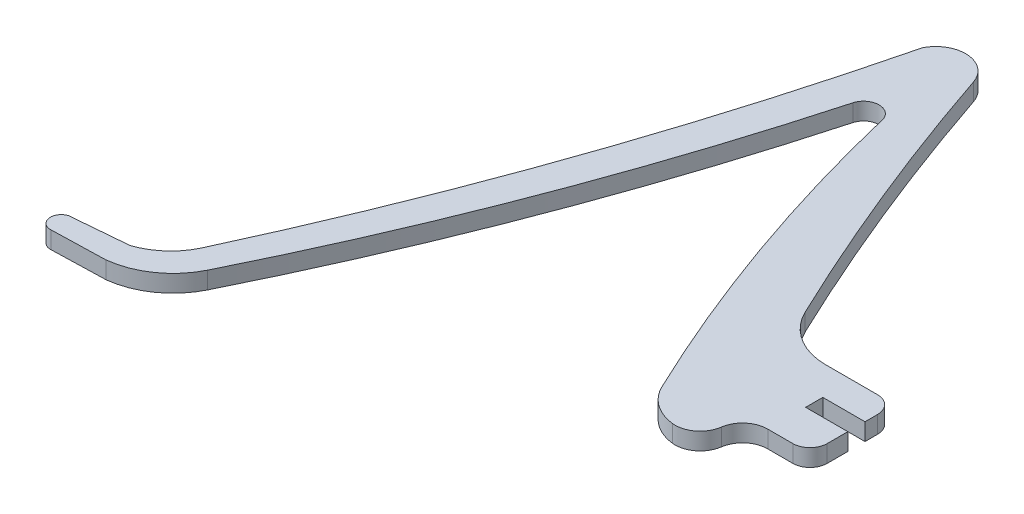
ISO-10303-21;
HEADER;
FILE_DESCRIPTION(('STEP AP214'),'2;1');
FILE_NAME('part.step','',(''),(''),'','','');
FILE_SCHEMA(('AUTOMOTIVE_DESIGN { 1 0 10303 214 1 1 1 1 }'));
ENDSEC;
DATA;
#1=APPLICATION_CONTEXT('core data for automotive mechanical design processes');
#2=APPLICATION_PROTOCOL_DEFINITION('international standard','automotive_design',2000,#1);
#3=PRODUCT_CONTEXT('',#1,'mechanical');
#4=PRODUCT('Part','Part','',(#3));
#5=PRODUCT_RELATED_PRODUCT_CATEGORY('part','',(#4));
#6=PRODUCT_DEFINITION_FORMATION('','',#4);
#7=PRODUCT_DEFINITION_CONTEXT('part definition',#1,'design');
#8=PRODUCT_DEFINITION('design','',#6,#7);
#9=PRODUCT_DEFINITION_SHAPE('','',#8);
#10=(LENGTH_UNIT() NAMED_UNIT(*) SI_UNIT(.MILLI.,.METRE.));
#11=(NAMED_UNIT(*) PLANE_ANGLE_UNIT() SI_UNIT($,.RADIAN.));
#12=(NAMED_UNIT(*) SI_UNIT($,.STERADIAN.) SOLID_ANGLE_UNIT());
#13=UNCERTAINTY_MEASURE_WITH_UNIT(LENGTH_MEASURE(1.E-05),#10,'distance_accuracy_value','');
#14=(GEOMETRIC_REPRESENTATION_CONTEXT(3) GLOBAL_UNCERTAINTY_ASSIGNED_CONTEXT((#13)) GLOBAL_UNIT_ASSIGNED_CONTEXT((#10,
#11,#12)) REPRESENTATION_CONTEXT('',''));
#15=CARTESIAN_POINT('',(0.,0.,0.));
#16=DIRECTION('',(0.,0.,1.));
#17=DIRECTION('',(1.,0.,0.));
#18=AXIS2_PLACEMENT_3D('',#15,#16,#17);
#19=CARTESIAN_POINT('',(-41738.6992189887,3.,-18363.9121093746));
#20=DIRECTION('',(0.,-1.,0.));
#21=DIRECTION('',(0.,0.,-1.));
#22=AXIS2_PLACEMENT_3D('',#19,#20,#21);
#23=CYLINDRICAL_SURFACE('',#22,1.8772510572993);
#24=CARTESIAN_POINT('',(-41738.6992189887,0.,-18363.9121093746));
#25=DIRECTION('',(0.,1.,0.));
#26=DIRECTION('',(0.,0.,1.));
#27=AXIS2_PLACEMENT_3D('',#24,#25,#26);
#28=CIRCLE('',#27,1.8772510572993);
#29=CARTESIAN_POINT('',(-41738.531777,0.,-18365.781878));
#30=VERTEX_POINT('',#29);
#31=CARTESIAN_POINT('',(-41738.64649,0.,-18362.035599));
#32=VERTEX_POINT('',#31);
#33=EDGE_CURVE('E228',#30,#32,#28,.T.);
#34=ORIENTED_EDGE('',*,*,#33,.T.);
#35=DIRECTION('',(0.,-1.,0.));
#36=VECTOR('',#35,1.);
#37=CARTESIAN_POINT('',(-41738.64649,3.,-18362.035599));
#38=LINE('',#37,#36);
#39=CARTESIAN_POINT('',(-41738.64649,3.,-18362.035599));
#40=VERTEX_POINT('',#39);
#41=EDGE_CURVE('E11',#40,#32,#38,.T.);
#42=ORIENTED_EDGE('',*,*,#41,.F.);
#43=CARTESIAN_POINT('',(-41738.6992189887,3.,-18363.9121093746));
#44=DIRECTION('',(0.,1.,0.));
#45=DIRECTION('',(0.,0.,1.));
#46=AXIS2_PLACEMENT_3D('',#43,#44,#45);
#47=CIRCLE('',#46,1.8772510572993);
#48=CARTESIAN_POINT('',(-41738.531777,3.,-18365.781878));
#49=VERTEX_POINT('',#48);
#50=EDGE_CURVE('E274',#49,#40,#47,.T.);
#51=ORIENTED_EDGE('',*,*,#50,.F.);
#52=DIRECTION('',(0.,-1.,0.));
#53=VECTOR('',#52,1.);
#54=CARTESIAN_POINT('',(-41738.531777,3.,-18365.781878));
#55=LINE('',#54,#53);
#56=EDGE_CURVE('E224',#49,#30,#55,.T.);
#57=ORIENTED_EDGE('',*,*,#56,.T.);
#58=EDGE_LOOP('',(#34,#42,#51,#57));
#59=FACE_BOUND('',#58,.T.);
#60=ADVANCED_FACE('F36',(#59),#23,.T.);
#61=CARTESIAN_POINT('',(-41738.64649,3.,-18362.035599));
#62=DIRECTION('',(-0.0281516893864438,0.,-0.999603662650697));
#63=DIRECTION('',(-0.999603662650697,0.,0.0281516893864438));
#64=AXIS2_PLACEMENT_3D('',#61,#62,#63);
#65=PLANE('',#64);
#66=DIRECTION('',(0.999603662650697,0.,-0.0281516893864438));
#67=VECTOR('',#66,1.);
#68=CARTESIAN_POINT('',(-41738.64649,0.,-18362.035599));
#69=LINE('',#68,#67);
#70=CARTESIAN_POINT('',(-41729.230469,0.,-18362.300781));
#71=VERTEX_POINT('',#70);
#72=EDGE_CURVE('E231',#32,#71,#69,.T.);
#73=ORIENTED_EDGE('',*,*,#72,.T.);
#74=DIRECTION('',(0.,-1.,0.));
#75=VECTOR('',#74,1.);
#76=CARTESIAN_POINT('',(-41729.230469,3.,-18362.300781));
#77=LINE('',#76,#75);
#78=CARTESIAN_POINT('',(-41729.230469,3.,-18362.300781));
#79=VERTEX_POINT('',#78);
#80=EDGE_CURVE('E44',#79,#71,#77,.T.);
#81=ORIENTED_EDGE('',*,*,#80,.F.);
#82=DIRECTION('',(0.999603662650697,0.,-0.0281516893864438));
#83=VECTOR('',#82,1.);
#84=CARTESIAN_POINT('',(-41738.64649,3.,-18362.035599));
#85=LINE('',#84,#83);
#86=EDGE_CURVE('E143',#40,#79,#85,.T.);
#87=ORIENTED_EDGE('',*,*,#86,.F.);
#88=ORIENTED_EDGE('',*,*,#41,.T.);
#89=EDGE_LOOP('',(#73,#81,#87,#88));
#90=FACE_BOUND('',#89,.T.);
#91=ADVANCED_FACE('F412',(#90),#65,.F.);
#92=CARTESIAN_POINT('',(-41730.7724777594,3.,-18375.5045827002));
#93=DIRECTION('',(0.,-1.,0.));
#94=DIRECTION('',(0.,0.,-1.));
#95=AXIS2_PLACEMENT_3D('',#92,#93,#94);
#96=CYLINDRICAL_SURFACE('',#95,13.2935386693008);
#97=CARTESIAN_POINT('',(-41730.7724777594,0.,-18375.5045827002));
#98=DIRECTION('',(0.,1.,0.));
#99=DIRECTION('',(0.,0.,1.));
#100=AXIS2_PLACEMENT_3D('',#97,#98,#99);
#101=CIRCLE('',#100,13.2935386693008);
#102=CARTESIAN_POINT('',(-41718.850758,0.,-18369.623191));
#103=VERTEX_POINT('',#102);
#104=EDGE_CURVE('E233',#71,#103,#101,.T.);
#105=ORIENTED_EDGE('',*,*,#104,.T.);
#106=DIRECTION('',(0.,-1.,0.));
#107=VECTOR('',#106,1.);
#108=CARTESIAN_POINT('',(-41718.850758,3.,-18369.623191));
#109=LINE('',#108,#107);
#110=CARTESIAN_POINT('',(-41718.850758,3.,-18369.623191));
#111=VERTEX_POINT('',#110);
#112=EDGE_CURVE('E329',#111,#103,#109,.T.);
#113=ORIENTED_EDGE('',*,*,#112,.F.);
#114=CARTESIAN_POINT('',(-41730.7724777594,3.,-18375.5045827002));
#115=DIRECTION('',(0.,1.,0.));
#116=DIRECTION('',(0.,0.,1.));
#117=AXIS2_PLACEMENT_3D('',#114,#115,#116);
#118=CIRCLE('',#117,13.2935386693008);
#119=EDGE_CURVE('E337',#79,#111,#118,.T.);
#120=ORIENTED_EDGE('',*,*,#119,.F.);
#121=ORIENTED_EDGE('',*,*,#80,.T.);
#122=EDGE_LOOP('',(#105,#113,#120,#121));
#123=FACE_BOUND('',#122,.T.);
#124=ADVANCED_FACE('F335',(#123),#96,.T.);
#125=CARTESIAN_POINT('',(-42131.7479660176,3.,-18573.2269802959));
#126=DIRECTION('',(0.,-1.,0.));
#127=DIRECTION('',(0.,0.,-1.));
#128=AXIS2_PLACEMENT_3D('',#125,#126,#127);
#129=CYLINDRICAL_SURFACE('',#128,460.367904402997);
#130=CARTESIAN_POINT('',(-42131.7479660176,0.,-18573.2269802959));
#131=DIRECTION('',(0.,1.,0.));
#132=DIRECTION('',(0.,0.,1.));
#133=AXIS2_PLACEMENT_3D('',#130,#131,#132);
#134=CIRCLE('',#133,460.367904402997);
#135=CARTESIAN_POINT('',(-41687.841823,0.,-18451.2190150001));
#136=VERTEX_POINT('',#135);
#137=EDGE_CURVE('E235',#103,#136,#134,.T.);
#138=ORIENTED_EDGE('',*,*,#137,.T.);
#139=DIRECTION('',(0.,-1.,0.));
#140=VECTOR('',#139,1.);
#141=CARTESIAN_POINT('',(-41687.841823,3.,-18451.2190150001));
#142=LINE('',#141,#140);
#143=CARTESIAN_POINT('',(-41687.841823,3.,-18451.2190150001));
#144=VERTEX_POINT('',#143);
#145=EDGE_CURVE('E326',#144,#136,#142,.T.);
#146=ORIENTED_EDGE('',*,*,#145,.F.);
#147=CARTESIAN_POINT('',(-42131.7479660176,3.,-18573.2269802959));
#148=DIRECTION('',(0.,1.,0.));
#149=DIRECTION('',(0.,0.,1.));
#150=AXIS2_PLACEMENT_3D('',#147,#148,#149);
#151=CIRCLE('',#150,460.367904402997);
#152=EDGE_CURVE('E355',#111,#144,#151,.T.);
#153=ORIENTED_EDGE('',*,*,#152,.F.);
#154=ORIENTED_EDGE('',*,*,#112,.T.);
#155=EDGE_LOOP('',(#138,#146,#153,#154));
#156=FACE_BOUND('',#155,.T.);
#157=ADVANCED_FACE('F346',(#156),#129,.T.);
#158=CARTESIAN_POINT('',(-41685.247483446,3.,-18450.5038166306));
#159=DIRECTION('',(0.,-1.,0.));
#160=DIRECTION('',(0.,0.,-1.));
#161=AXIS2_PLACEMENT_3D('',#158,#159,#160);
#162=CYLINDRICAL_SURFACE('',#161,2.69111620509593);
#163=CARTESIAN_POINT('',(-41685.247483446,0.,-18450.5038166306));
#164=DIRECTION('',(0.,-1.,0.));
#165=DIRECTION('',(0.,0.,1.));
#166=AXIS2_PLACEMENT_3D('',#163,#164,#165);
#167=CIRCLE('',#166,2.69111620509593);
#168=CARTESIAN_POINT('',(-41682.766146,0.,-18451.545484));
#169=VERTEX_POINT('',#168);
#170=EDGE_CURVE('E237',#136,#169,#167,.T.);
#171=ORIENTED_EDGE('',*,*,#170,.T.);
#172=DIRECTION('',(0.,-1.,0.));
#173=VECTOR('',#172,1.);
#174=CARTESIAN_POINT('',(-41682.766146,3.,-18451.545484));
#175=LINE('',#174,#173);
#176=CARTESIAN_POINT('',(-41682.766146,3.,-18451.545484));
#177=VERTEX_POINT('',#176);
#178=EDGE_CURVE('E323',#177,#169,#175,.T.);
#179=ORIENTED_EDGE('',*,*,#178,.F.);
#180=CARTESIAN_POINT('',(-41685.247483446,3.,-18450.5038166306));
#181=DIRECTION('',(0.,-1.,0.));
#182=DIRECTION('',(0.,0.,1.));
#183=AXIS2_PLACEMENT_3D('',#180,#181,#182);
#184=CIRCLE('',#183,2.69111620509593);
#185=EDGE_CURVE('E352',#144,#177,#184,.T.);
#186=ORIENTED_EDGE('',*,*,#185,.F.);
#187=ORIENTED_EDGE('',*,*,#145,.T.);
#188=EDGE_LOOP('',(#171,#179,#186,#187));
#189=FACE_BOUND('',#188,.T.);
#190=ADVANCED_FACE('F350',(#189),#162,.F.);
#191=CARTESIAN_POINT('',(-41390.6482191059,3.,-18521.1719345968));
#192=DIRECTION('',(0.,-1.,0.));
#193=DIRECTION('',(0.,0.,-1.));
#194=AXIS2_PLACEMENT_3D('',#191,#192,#193);
#195=CYLINDRICAL_SURFACE('',#194,300.301058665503);
#196=CARTESIAN_POINT('',(-41390.6482191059,0.,-18521.1719345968));
#197=DIRECTION('',(0.,1.,0.));
#198=DIRECTION('',(0.,0.,1.));
#199=AXIS2_PLACEMENT_3D('',#196,#197,#198);
#200=CIRCLE('',#199,300.301058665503);
#201=CARTESIAN_POINT('',(-41661.5612450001,0.,-18391.607826));
#202=VERTEX_POINT('',#201);
#203=EDGE_CURVE('E239',#169,#202,#200,.T.);
#204=ORIENTED_EDGE('',*,*,#203,.T.);
#205=DIRECTION('',(0.,-1.,0.));
#206=VECTOR('',#205,1.);
#207=CARTESIAN_POINT('',(-41661.5612450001,3.,-18391.607826));
#208=LINE('',#207,#206);
#209=CARTESIAN_POINT('',(-41661.5612450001,3.,-18391.607826));
#210=VERTEX_POINT('',#209);
#211=EDGE_CURVE('E320',#210,#202,#208,.T.);
#212=ORIENTED_EDGE('',*,*,#211,.F.);
#213=CARTESIAN_POINT('',(-41390.6482191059,3.,-18521.1719345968));
#214=DIRECTION('',(0.,1.,0.));
#215=DIRECTION('',(0.,0.,1.));
#216=AXIS2_PLACEMENT_3D('',#213,#214,#215);
#217=CIRCLE('',#216,300.301058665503);
#218=EDGE_CURVE('E354',#177,#210,#217,.T.);
#219=ORIENTED_EDGE('',*,*,#218,.F.);
#220=ORIENTED_EDGE('',*,*,#178,.T.);
#221=EDGE_LOOP('',(#204,#212,#219,#220));
#222=FACE_BOUND('',#221,.T.);
#223=ADVANCED_FACE('F425',(#222),#195,.T.);
#224=CARTESIAN_POINT('',(-41654.1774722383,3.,-18395.1398811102));
#225=DIRECTION('',(0.,-1.,0.));
#226=DIRECTION('',(0.,0.,-1.));
#227=AXIS2_PLACEMENT_3D('',#224,#225,#226);
#228=CYLINDRICAL_SURFACE('',#227,8.18507871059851);
#229=CARTESIAN_POINT('',(-41654.1774722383,0.,-18395.1398811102));
#230=DIRECTION('',(0.,1.,0.));
#231=DIRECTION('',(0.,0.,1.));
#232=AXIS2_PLACEMENT_3D('',#229,#230,#231);
#233=CIRCLE('',#232,8.18507871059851);
#234=CARTESIAN_POINT('',(-41655.13076,0.,-18387.0105049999));
#235=VERTEX_POINT('',#234);
#236=EDGE_CURVE('E241',#202,#235,#233,.T.);
#237=ORIENTED_EDGE('',*,*,#236,.T.);
#238=DIRECTION('',(0.,-1.,0.));
#239=VECTOR('',#238,1.);
#240=CARTESIAN_POINT('',(-41655.13076,3.,-18387.0105049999));
#241=LINE('',#240,#239);
#242=CARTESIAN_POINT('',(-41655.13076,3.,-18387.0105049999));
#243=VERTEX_POINT('',#242);
#244=EDGE_CURVE('E317',#243,#235,#241,.T.);
#245=ORIENTED_EDGE('',*,*,#244,.F.);
#246=CARTESIAN_POINT('',(-41654.1774722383,3.,-18395.1398811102));
#247=DIRECTION('',(0.,1.,0.));
#248=DIRECTION('',(0.,0.,1.));
#249=AXIS2_PLACEMENT_3D('',#246,#247,#248);
#250=CIRCLE('',#249,8.18507871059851);
#251=EDGE_CURVE('E357',#210,#243,#250,.T.);
#252=ORIENTED_EDGE('',*,*,#251,.F.);
#253=ORIENTED_EDGE('',*,*,#211,.T.);
#254=EDGE_LOOP('',(#237,#245,#252,#253));
#255=FACE_BOUND('',#254,.T.);
#256=ADVANCED_FACE('F428',(#255),#228,.T.);
#257=CARTESIAN_POINT('',(-41654.621781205,3.,-18391.3510327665));
#258=DIRECTION('',(0.,-1.,0.));
#259=DIRECTION('',(0.,0.,-1.));
#260=AXIS2_PLACEMENT_3D('',#257,#258,#259);
#261=CYLINDRICAL_SURFACE('',#260,4.37026780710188);
#262=CARTESIAN_POINT('',(-41654.621781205,0.,-18391.3510327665));
#263=DIRECTION('',(0.,1.,0.));
#264=DIRECTION('',(0.,0.,1.));
#265=AXIS2_PLACEMENT_3D('',#262,#263,#264);
#266=CIRCLE('',#265,4.37026780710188);
#267=CARTESIAN_POINT('',(-41650.295225,0.,-18390.734468));
#268=VERTEX_POINT('',#267);
#269=EDGE_CURVE('E243',#235,#268,#266,.T.);
#270=ORIENTED_EDGE('',*,*,#269,.T.);
#271=DIRECTION('',(0.,-1.,0.));
#272=VECTOR('',#271,1.);
#273=CARTESIAN_POINT('',(-41650.295225,3.,-18390.734468));
#274=LINE('',#273,#272);
#275=CARTESIAN_POINT('',(-41650.295225,3.,-18390.734468));
#276=VERTEX_POINT('',#275);
#277=EDGE_CURVE('E314',#276,#268,#274,.T.);
#278=ORIENTED_EDGE('',*,*,#277,.F.);
#279=CARTESIAN_POINT('',(-41654.621781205,3.,-18391.3510327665));
#280=DIRECTION('',(0.,1.,0.));
#281=DIRECTION('',(0.,0.,1.));
#282=AXIS2_PLACEMENT_3D('',#279,#280,#281);
#283=CIRCLE('',#282,4.37026780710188);
#284=EDGE_CURVE('E363',#243,#276,#283,.T.);
#285=ORIENTED_EDGE('',*,*,#284,.F.);
#286=ORIENTED_EDGE('',*,*,#244,.T.);
#287=EDGE_LOOP('',(#270,#278,#285,#286));
#288=FACE_BOUND('',#287,.T.);
#289=ADVANCED_FACE('F432',(#288),#261,.T.);
#290=CARTESIAN_POINT('',(-41645.9821666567,3.,-18390.1176820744));
#291=DIRECTION('',(0.,-1.,0.));
#292=DIRECTION('',(0.,0.,-1.));
#293=AXIS2_PLACEMENT_3D('',#290,#291,#292);
#294=CYLINDRICAL_SURFACE('',#293,4.35693667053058);
#295=CARTESIAN_POINT('',(-41645.9821666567,0.,-18390.1176820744));
#296=DIRECTION('',(0.,-1.,0.));
#297=DIRECTION('',(0.,0.,1.));
#298=AXIS2_PLACEMENT_3D('',#295,#296,#297);
#299=CIRCLE('',#298,4.35693667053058);
#300=CARTESIAN_POINT('',(-41645.943257,0.,-18394.4744449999));
#301=VERTEX_POINT('',#300);
#302=EDGE_CURVE('E245',#268,#301,#299,.T.);
#303=ORIENTED_EDGE('',*,*,#302,.T.);
#304=DIRECTION('',(0.,-1.,0.));
#305=VECTOR('',#304,1.);
#306=CARTESIAN_POINT('',(-41645.943257,3.,-18394.4744449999));
#307=LINE('',#306,#305);
#308=CARTESIAN_POINT('',(-41645.943257,3.,-18394.4744449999));
#309=VERTEX_POINT('',#308);
#310=EDGE_CURVE('E311',#309,#301,#307,.T.);
#311=ORIENTED_EDGE('',*,*,#310,.F.);
#312=CARTESIAN_POINT('',(-41645.9821666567,3.,-18390.1176820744));
#313=DIRECTION('',(0.,-1.,0.));
#314=DIRECTION('',(0.,0.,1.));
#315=AXIS2_PLACEMENT_3D('',#312,#313,#314);
#316=CIRCLE('',#315,4.35693667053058);
#317=EDGE_CURVE('E365',#276,#309,#316,.T.);
#318=ORIENTED_EDGE('',*,*,#317,.F.);
#319=ORIENTED_EDGE('',*,*,#277,.T.);
#320=EDGE_LOOP('',(#303,#311,#318,#319));
#321=FACE_BOUND('',#320,.T.);
#322=ADVANCED_FACE('F436',(#321),#294,.F.);
#323=CARTESIAN_POINT('',(-41645.943257,3.,-18394.4744449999));
#324=DIRECTION('',(-0.000484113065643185,0.,-0.999999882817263));
#325=DIRECTION('',(-0.999999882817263,0.,0.000484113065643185));
#326=AXIS2_PLACEMENT_3D('',#323,#324,#325);
#327=PLANE('',#326);
#328=DIRECTION('',(0.999999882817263,0.,-0.000484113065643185));
#329=VECTOR('',#328,1.);
#330=CARTESIAN_POINT('',(-41645.943257,0.,-18394.4744449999));
#331=LINE('',#330,#329);
#332=CARTESIAN_POINT('',(-41641.570312,0.,-18394.476562));
#333=VERTEX_POINT('',#332);
#334=EDGE_CURVE('E247',#301,#333,#331,.T.);
#335=ORIENTED_EDGE('',*,*,#334,.T.);
#336=DIRECTION('',(0.,-1.,0.));
#337=VECTOR('',#336,1.);
#338=CARTESIAN_POINT('',(-41641.570312,3.,-18394.476562));
#339=LINE('',#338,#337);
#340=CARTESIAN_POINT('',(-41641.570312,3.,-18394.476562));
#341=VERTEX_POINT('',#340);
#342=EDGE_CURVE('E308',#341,#333,#339,.T.);
#343=ORIENTED_EDGE('',*,*,#342,.F.);
#344=DIRECTION('',(0.999999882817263,0.,-0.000484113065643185));
#345=VECTOR('',#344,1.);
#346=CARTESIAN_POINT('',(-41645.943257,3.,-18394.4744449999));
#347=LINE('',#346,#345);
#348=EDGE_CURVE('E367',#309,#341,#347,.T.);
#349=ORIENTED_EDGE('',*,*,#348,.F.);
#350=ORIENTED_EDGE('',*,*,#310,.T.);
#351=EDGE_LOOP('',(#335,#343,#349,#350));
#352=FACE_BOUND('',#351,.T.);
#353=ADVANCED_FACE('F440',(#352),#327,.F.);
#354=CARTESIAN_POINT('',(-41641.5703122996,3.,-18397.4765617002));
#355=DIRECTION('',(0.,-1.,0.));
#356=DIRECTION('',(0.,0.,-1.));
#357=AXIS2_PLACEMENT_3D('',#354,#355,#356);
#358=CYLINDRICAL_SURFACE('',#357,2.99999970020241);
#359=CARTESIAN_POINT('',(-41641.5703122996,0.,-18397.4765617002));
#360=DIRECTION('',(0.,1.,0.));
#361=DIRECTION('',(0.,0.,1.));
#362=AXIS2_PLACEMENT_3D('',#359,#360,#361);
#363=CIRCLE('',#362,2.99999970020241);
#364=CARTESIAN_POINT('',(-41638.570313,0.,-18397.478112));
#365=VERTEX_POINT('',#364);
#366=EDGE_CURVE('E249',#333,#365,#363,.T.);
#367=ORIENTED_EDGE('',*,*,#366,.T.);
#368=DIRECTION('',(0.,-1.,0.));
#369=VECTOR('',#368,1.);
#370=CARTESIAN_POINT('',(-41638.570313,3.,-18397.478112));
#371=LINE('',#370,#369);
#372=CARTESIAN_POINT('',(-41638.570313,3.,-18397.478112));
#373=VERTEX_POINT('',#372);
#374=EDGE_CURVE('E305',#373,#365,#371,.T.);
#375=ORIENTED_EDGE('',*,*,#374,.F.);
#376=CARTESIAN_POINT('',(-41641.5703122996,3.,-18397.4765617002));
#377=DIRECTION('',(0.,1.,0.));
#378=DIRECTION('',(0.,0.,1.));
#379=AXIS2_PLACEMENT_3D('',#376,#377,#378);
#380=CIRCLE('',#379,2.99999970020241);
#381=EDGE_CURVE('E369',#341,#373,#380,.T.);
#382=ORIENTED_EDGE('',*,*,#381,.F.);
#383=ORIENTED_EDGE('',*,*,#342,.T.);
#384=EDGE_LOOP('',(#367,#375,#382,#383));
#385=FACE_BOUND('',#384,.T.);
#386=ADVANCED_FACE('F444',(#385),#358,.T.);
#387=CARTESIAN_POINT('',(-41638.570313,3.,-18397.478112));
#388=DIRECTION('',(-0.999999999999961,0.,-2.78067644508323E-07));
#389=DIRECTION('',(-2.78067644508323E-07,0.,0.999999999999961));
#390=AXIS2_PLACEMENT_3D('',#387,#388,#389);
#391=PLANE('',#390);
#392=DIRECTION('',(2.78067644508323E-07,0.,-0.999999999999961));
#393=VECTOR('',#392,1.);
#394=CARTESIAN_POINT('',(-41638.570313,0.,-18397.478112));
#395=LINE('',#394,#393);
#396=CARTESIAN_POINT('',(-41638.570312,0.,-18401.074219));
#397=VERTEX_POINT('',#396);
#398=EDGE_CURVE('E251',#365,#397,#395,.T.);
#399=ORIENTED_EDGE('',*,*,#398,.T.);
#400=DIRECTION('',(0.,-1.,0.));
#401=VECTOR('',#400,1.);
#402=CARTESIAN_POINT('',(-41638.570312,3.,-18401.074219));
#403=LINE('',#402,#401);
#404=CARTESIAN_POINT('',(-41638.570312,3.,-18401.074219));
#405=VERTEX_POINT('',#404);
#406=EDGE_CURVE('E302',#405,#397,#403,.T.);
#407=ORIENTED_EDGE('',*,*,#406,.F.);
#408=DIRECTION('',(2.78067644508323E-07,0.,-0.999999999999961));
#409=VECTOR('',#408,1.);
#410=CARTESIAN_POINT('',(-41638.570313,3.,-18397.478112));
#411=LINE('',#410,#409);
#412=EDGE_CURVE('E371',#373,#405,#411,.T.);
#413=ORIENTED_EDGE('',*,*,#412,.F.);
#414=ORIENTED_EDGE('',*,*,#374,.T.);
#415=EDGE_LOOP('',(#399,#407,#413,#414));
#416=FACE_BOUND('',#415,.T.);
#417=ADVANCED_FACE('F448',(#416),#391,.F.);
#418=CARTESIAN_POINT('',(-41638.570312,3.,-18401.074219));
#419=DIRECTION('',(0.,0.,1.));
#420=DIRECTION('',(1.,0.,0.));
#421=AXIS2_PLACEMENT_3D('',#418,#419,#420);
#422=PLANE('',#421);
#423=DIRECTION('',(-1.,0.,0.));
#424=VECTOR('',#423,1.);
#425=CARTESIAN_POINT('',(-41638.570312,0.,-18401.074219));
#426=LINE('',#425,#424);
#427=CARTESIAN_POINT('',(-41645.933594,0.,-18401.074219));
#428=VERTEX_POINT('',#427);
#429=EDGE_CURVE('E253',#397,#428,#426,.T.);
#430=ORIENTED_EDGE('',*,*,#429,.T.);
#431=DIRECTION('',(0.,-1.,0.));
#432=VECTOR('',#431,1.);
#433=CARTESIAN_POINT('',(-41645.933594,3.,-18401.074219));
#434=LINE('',#433,#432);
#435=CARTESIAN_POINT('',(-41645.933594,3.,-18401.074219));
#436=VERTEX_POINT('',#435);
#437=EDGE_CURVE('E299',#436,#428,#434,.T.);
#438=ORIENTED_EDGE('',*,*,#437,.F.);
#439=DIRECTION('',(-1.,0.,0.));
#440=VECTOR('',#439,1.);
#441=CARTESIAN_POINT('',(-41638.570312,3.,-18401.074219));
#442=LINE('',#441,#440);
#443=EDGE_CURVE('E373',#405,#436,#442,.T.);
#444=ORIENTED_EDGE('',*,*,#443,.F.);
#445=ORIENTED_EDGE('',*,*,#406,.T.);
#446=EDGE_LOOP('',(#430,#438,#444,#445));
#447=FACE_BOUND('',#446,.T.);
#448=ADVANCED_FACE('F452',(#447),#422,.F.);
#449=CARTESIAN_POINT('',(-41645.933594,3.,-18401.074219));
#450=DIRECTION('',(-0.999999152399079,0.,0.00130199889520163));
#451=DIRECTION('',(0.00130199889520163,0.,0.999999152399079));
#452=AXIS2_PLACEMENT_3D('',#449,#450,#451);
#453=PLANE('',#452);
#454=DIRECTION('',(-0.00130199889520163,0.,-0.999999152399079));
#455=VECTOR('',#454,1.);
#456=CARTESIAN_POINT('',(-41645.933594,0.,-18401.074219));
#457=LINE('',#456,#455);
#458=CARTESIAN_POINT('',(-41645.9375,0.,-18404.074219));
#459=VERTEX_POINT('',#458);
#460=EDGE_CURVE('E255',#428,#459,#457,.T.);
#461=ORIENTED_EDGE('',*,*,#460,.T.);
#462=DIRECTION('',(0.,-1.,0.));
#463=VECTOR('',#462,1.);
#464=CARTESIAN_POINT('',(-41645.9375,3.,-18404.074219));
#465=LINE('',#464,#463);
#466=CARTESIAN_POINT('',(-41645.9375,3.,-18404.074219));
#467=VERTEX_POINT('',#466);
#468=EDGE_CURVE('E296',#467,#459,#465,.T.);
#469=ORIENTED_EDGE('',*,*,#468,.F.);
#470=DIRECTION('',(-0.00130199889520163,0.,-0.999999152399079));
#471=VECTOR('',#470,1.);
#472=CARTESIAN_POINT('',(-41645.933594,3.,-18401.074219));
#473=LINE('',#472,#471);
#474=EDGE_CURVE('E375',#436,#467,#473,.T.);
#475=ORIENTED_EDGE('',*,*,#474,.F.);
#476=ORIENTED_EDGE('',*,*,#437,.T.);
#477=EDGE_LOOP('',(#461,#469,#475,#476));
#478=FACE_BOUND('',#477,.T.);
#479=ADVANCED_FACE('F456',(#478),#453,.F.);
#480=CARTESIAN_POINT('',(-41645.9375,3.,-18404.074219));
#481=DIRECTION('',(0.,0.,-1.));
#482=DIRECTION('',(-1.,0.,0.));
#483=AXIS2_PLACEMENT_3D('',#480,#481,#482);
#484=PLANE('',#483);
#485=DIRECTION('',(1.,0.,0.));
#486=VECTOR('',#485,1.);
#487=CARTESIAN_POINT('',(-41645.9375,0.,-18404.074219));
#488=LINE('',#487,#486);
#489=CARTESIAN_POINT('',(-41638.574219,0.,-18404.074219));
#490=VERTEX_POINT('',#489);
#491=EDGE_CURVE('E257',#459,#490,#488,.T.);
#492=ORIENTED_EDGE('',*,*,#491,.T.);
#493=DIRECTION('',(0.,-1.,0.));
#494=VECTOR('',#493,1.);
#495=CARTESIAN_POINT('',(-41638.574219,3.,-18404.074219));
#496=LINE('',#495,#494);
#497=CARTESIAN_POINT('',(-41638.574219,3.,-18404.074219));
#498=VERTEX_POINT('',#497);
#499=EDGE_CURVE('E293',#498,#490,#496,.T.);
#500=ORIENTED_EDGE('',*,*,#499,.F.);
#501=DIRECTION('',(1.,0.,0.));
#502=VECTOR('',#501,1.);
#503=CARTESIAN_POINT('',(-41645.9375,3.,-18404.074219));
#504=LINE('',#503,#502);
#505=EDGE_CURVE('E377',#467,#498,#504,.T.);
#506=ORIENTED_EDGE('',*,*,#505,.F.);
#507=ORIENTED_EDGE('',*,*,#468,.T.);
#508=EDGE_LOOP('',(#492,#500,#506,#507));
#509=FACE_BOUND('',#508,.T.);
#510=ADVANCED_FACE('F460',(#509),#484,.F.);
#511=CARTESIAN_POINT('',(-41638.574219,3.,-18404.074219));
#512=DIRECTION('',(-0.999998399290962,0.,-0.0017892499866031));
#513=DIRECTION('',(-0.0017892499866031,0.,0.999998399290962));
#514=AXIS2_PLACEMENT_3D('',#511,#512,#513);
#515=PLANE('',#514);
#516=DIRECTION('',(0.0017892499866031,0.,-0.999998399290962));
#517=VECTOR('',#516,1.);
#518=CARTESIAN_POINT('',(-41638.574219,0.,-18404.074219));
#519=LINE('',#518,#517);
#520=CARTESIAN_POINT('',(-41638.570312,0.,-18406.257812));
#521=VERTEX_POINT('',#520);
#522=EDGE_CURVE('E259',#490,#521,#519,.T.);
#523=ORIENTED_EDGE('',*,*,#522,.T.);
#524=DIRECTION('',(0.,-1.,0.));
#525=VECTOR('',#524,1.);
#526=CARTESIAN_POINT('',(-41638.570312,3.,-18406.257812));
#527=LINE('',#526,#525);
#528=CARTESIAN_POINT('',(-41638.570312,3.,-18406.257812));
#529=VERTEX_POINT('',#528);
#530=EDGE_CURVE('E290',#529,#521,#527,.T.);
#531=ORIENTED_EDGE('',*,*,#530,.F.);
#532=DIRECTION('',(0.0017892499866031,0.,-0.999998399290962));
#533=VECTOR('',#532,1.);
#534=CARTESIAN_POINT('',(-41638.574219,3.,-18404.074219));
#535=LINE('',#534,#533);
#536=EDGE_CURVE('E379',#498,#529,#535,.T.);
#537=ORIENTED_EDGE('',*,*,#536,.F.);
#538=ORIENTED_EDGE('',*,*,#499,.T.);
#539=EDGE_LOOP('',(#523,#531,#537,#538));
#540=FACE_BOUND('',#539,.T.);
#541=ADVANCED_FACE('F464',(#540),#515,.F.);
#542=CARTESIAN_POINT('',(-41641.5722642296,3.,-18406.2558597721));
#543=DIRECTION('',(0.,-1.,0.));
#544=DIRECTION('',(0.,0.,-1.));
#545=AXIS2_PLACEMENT_3D('',#542,#543,#544);
#546=CYLINDRICAL_SURFACE('',#545,3.00195286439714);
#547=CARTESIAN_POINT('',(-41641.5722642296,0.,-18406.2558597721));
#548=DIRECTION('',(0.,1.,0.));
#549=DIRECTION('',(0.,0.,1.));
#550=AXIS2_PLACEMENT_3D('',#547,#548,#549);
#551=CIRCLE('',#550,3.00195286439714);
#552=CARTESIAN_POINT('',(-41641.574219,0.,-18409.2578120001));
#553=VERTEX_POINT('',#552);
#554=EDGE_CURVE('E261',#521,#553,#551,.T.);
#555=ORIENTED_EDGE('',*,*,#554,.T.);
#556=DIRECTION('',(0.,-1.,0.));
#557=VECTOR('',#556,1.);
#558=CARTESIAN_POINT('',(-41641.574219,3.,-18409.2578120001));
#559=LINE('',#558,#557);
#560=CARTESIAN_POINT('',(-41641.574219,3.,-18409.2578120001));
#561=VERTEX_POINT('',#560);
#562=EDGE_CURVE('E287',#561,#553,#559,.T.);
#563=ORIENTED_EDGE('',*,*,#562,.F.);
#564=CARTESIAN_POINT('',(-41641.5722642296,3.,-18406.2558597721));
#565=DIRECTION('',(0.,1.,0.));
#566=DIRECTION('',(0.,0.,1.));
#567=AXIS2_PLACEMENT_3D('',#564,#565,#566);
#568=CIRCLE('',#567,3.00195286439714);
#569=EDGE_CURVE('E381',#529,#561,#568,.T.);
#570=ORIENTED_EDGE('',*,*,#569,.F.);
#571=ORIENTED_EDGE('',*,*,#530,.T.);
#572=EDGE_LOOP('',(#555,#563,#570,#571));
#573=FACE_BOUND('',#572,.T.);
#574=ADVANCED_FACE('F468',(#573),#546,.T.);
#575=CARTESIAN_POINT('',(-41641.574219,3.,-18409.2578120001));
#576=DIRECTION('',(0.000209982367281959,0.,0.999999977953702));
#577=DIRECTION('',(0.999999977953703,0.,-0.000209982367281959));
#578=AXIS2_PLACEMENT_3D('',#575,#576,#577);
#579=PLANE('',#578);
#580=DIRECTION('',(-0.999999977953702,0.,0.000209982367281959));
#581=VECTOR('',#580,1.);
#582=CARTESIAN_POINT('',(-41641.574219,0.,-18409.2578120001));
#583=LINE('',#582,#581);
#584=CARTESIAN_POINT('',(-41650.875,0.,-18409.255859));
#585=VERTEX_POINT('',#584);
#586=EDGE_CURVE('E263',#553,#585,#583,.T.);
#587=ORIENTED_EDGE('',*,*,#586,.T.);
#588=DIRECTION('',(0.,-1.,0.));
#589=VECTOR('',#588,1.);
#590=CARTESIAN_POINT('',(-41650.875,3.,-18409.255859));
#591=LINE('',#590,#589);
#592=CARTESIAN_POINT('',(-41650.875,3.,-18409.255859));
#593=VERTEX_POINT('',#592);
#594=EDGE_CURVE('E284',#593,#585,#591,.T.);
#595=ORIENTED_EDGE('',*,*,#594,.F.);
#596=DIRECTION('',(-0.999999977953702,0.,0.000209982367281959));
#597=VECTOR('',#596,1.);
#598=CARTESIAN_POINT('',(-41641.574219,3.,-18409.2578120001));
#599=LINE('',#598,#597);
#600=EDGE_CURVE('E383',#561,#593,#599,.T.);
#601=ORIENTED_EDGE('',*,*,#600,.F.);
#602=ORIENTED_EDGE('',*,*,#562,.T.);
#603=EDGE_LOOP('',(#587,#595,#601,#602));
#604=FACE_BOUND('',#603,.T.);
#605=ADVANCED_FACE('F472',(#604),#579,.F.);
#606=CARTESIAN_POINT('',(-41650.5723416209,3.,-18420.1081544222));
#607=DIRECTION('',(0.,-1.,0.));
#608=DIRECTION('',(0.,0.,-1.));
#609=AXIS2_PLACEMENT_3D('',#606,#607,#608);
#610=CYLINDRICAL_SURFACE('',#609,10.8565150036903);
#611=CARTESIAN_POINT('',(-41650.5723416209,0.,-18420.1081544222));
#612=DIRECTION('',(0.,-1.,0.));
#613=DIRECTION('',(0.,0.,1.));
#614=AXIS2_PLACEMENT_3D('',#611,#612,#613);
#615=CIRCLE('',#614,10.8565150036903);
#616=CARTESIAN_POINT('',(-41660.3681950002,0.,-18415.4278580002));
#617=VERTEX_POINT('',#616);
#618=EDGE_CURVE('E265',#585,#617,#615,.T.);
#619=ORIENTED_EDGE('',*,*,#618,.T.);
#620=DIRECTION('',(0.,-1.,0.));
#621=VECTOR('',#620,1.);
#622=CARTESIAN_POINT('',(-41660.3681950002,3.,-18415.4278580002));
#623=LINE('',#622,#621);
#624=CARTESIAN_POINT('',(-41660.3681950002,3.,-18415.4278580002));
#625=VERTEX_POINT('',#624);
#626=EDGE_CURVE('E281',#625,#617,#623,.T.);
#627=ORIENTED_EDGE('',*,*,#626,.F.);
#628=CARTESIAN_POINT('',(-41650.5723416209,3.,-18420.1081544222));
#629=DIRECTION('',(0.,-1.,0.));
#630=DIRECTION('',(0.,0.,1.));
#631=AXIS2_PLACEMENT_3D('',#628,#629,#630);
#632=CIRCLE('',#631,10.8565150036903);
#633=EDGE_CURVE('E385',#593,#625,#632,.T.);
#634=ORIENTED_EDGE('',*,*,#633,.F.);
#635=ORIENTED_EDGE('',*,*,#594,.T.);
#636=EDGE_LOOP('',(#619,#627,#634,#635));
#637=FACE_BOUND('',#636,.T.);
#638=ADVANCED_FACE('F476',(#637),#610,.F.);
#639=CARTESIAN_POINT('',(-41258.7053210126,3.,-18607.4295335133));
#640=DIRECTION('',(0.,-1.,0.));
#641=DIRECTION('',(0.,0.,-1.));
#642=AXIS2_PLACEMENT_3D('',#639,#640,#641);
#643=CYLINDRICAL_SURFACE('',#642,445.1940113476);
#644=CARTESIAN_POINT('',(-41258.7053210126,0.,-18607.4295335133));
#645=DIRECTION('',(0.,-1.,0.));
#646=DIRECTION('',(0.,0.,1.));
#647=AXIS2_PLACEMENT_3D('',#644,#645,#646);
#648=CIRCLE('',#647,445.1940113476);
#649=CARTESIAN_POINT('',(-41680.482514,0.,-18464.9454739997));
#650=VERTEX_POINT('',#649);
#651=EDGE_CURVE('E267',#617,#650,#648,.T.);
#652=ORIENTED_EDGE('',*,*,#651,.T.);
#653=DIRECTION('',(0.,-1.,0.));
#654=VECTOR('',#653,1.);
#655=CARTESIAN_POINT('',(-41680.482514,3.,-18464.9454739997));
#656=LINE('',#655,#654);
#657=CARTESIAN_POINT('',(-41680.482514,3.,-18464.9454739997));
#658=VERTEX_POINT('',#657);
#659=EDGE_CURVE('E278',#658,#650,#656,.T.);
#660=ORIENTED_EDGE('',*,*,#659,.F.);
#661=CARTESIAN_POINT('',(-41258.7053210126,3.,-18607.4295335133));
#662=DIRECTION('',(0.,-1.,0.));
#663=DIRECTION('',(0.,0.,1.));
#664=AXIS2_PLACEMENT_3D('',#661,#662,#663);
#665=CIRCLE('',#664,445.1940113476);
#666=EDGE_CURVE('E387',#625,#658,#665,.T.);
#667=ORIENTED_EDGE('',*,*,#666,.F.);
#668=ORIENTED_EDGE('',*,*,#626,.T.);
#669=EDGE_LOOP('',(#652,#660,#667,#668));
#670=FACE_BOUND('',#669,.T.);
#671=ADVANCED_FACE('F393',(#670),#643,.F.);
#672=CARTESIAN_POINT('',(-41685.4289242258,3.,-18463.2733799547));
#673=DIRECTION('',(0.,-1.,0.));
#674=DIRECTION('',(0.,0.,-1.));
#675=AXIS2_PLACEMENT_3D('',#672,#673,#674);
#676=CYLINDRICAL_SURFACE('',#675,5.22138608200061);
#677=CARTESIAN_POINT('',(-41685.4289242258,0.,-18463.2733799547));
#678=DIRECTION('',(0.,1.,0.));
#679=DIRECTION('',(0.,0.,1.));
#680=AXIS2_PLACEMENT_3D('',#677,#678,#679);
#681=CIRCLE('',#680,5.22138608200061);
#682=CARTESIAN_POINT('',(-41690.071601,0.,-18465.6626109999));
#683=VERTEX_POINT('',#682);
#684=EDGE_CURVE('E269',#650,#683,#681,.T.);
#685=ORIENTED_EDGE('',*,*,#684,.T.);
#686=DIRECTION('',(0.,-1.,0.));
#687=VECTOR('',#686,1.);
#688=CARTESIAN_POINT('',(-41690.071601,3.,-18465.6626109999));
#689=LINE('',#688,#687);
#690=CARTESIAN_POINT('',(-41690.071601,3.,-18465.6626109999));
#691=VERTEX_POINT('',#690);
#692=EDGE_CURVE('E219',#691,#683,#689,.T.);
#693=ORIENTED_EDGE('',*,*,#692,.F.);
#694=CARTESIAN_POINT('',(-41685.4289242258,3.,-18463.2733799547));
#695=DIRECTION('',(0.,1.,0.));
#696=DIRECTION('',(0.,0.,1.));
#697=AXIS2_PLACEMENT_3D('',#694,#695,#696);
#698=CIRCLE('',#697,5.22138608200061);
#699=EDGE_CURVE('E210',#658,#691,#698,.T.);
#700=ORIENTED_EDGE('',*,*,#699,.F.);
#701=ORIENTED_EDGE('',*,*,#659,.T.);
#702=EDGE_LOOP('',(#685,#693,#700,#701));
#703=FACE_BOUND('',#702,.T.);
#704=ADVANCED_FACE('F397',(#703),#676,.T.);
#705=CARTESIAN_POINT('',(-42191.3702686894,3.,-18588.9521432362));
#706=DIRECTION('',(0.,-1.,0.));
#707=DIRECTION('',(0.,0.,-1.));
#708=AXIS2_PLACEMENT_3D('',#705,#706,#707);
#709=CYLINDRICAL_SURFACE('',#708,516.237022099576);
#710=CARTESIAN_POINT('',(-42191.3702686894,0.,-18588.9521432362));
#711=DIRECTION('',(0.,-1.,0.));
#712=DIRECTION('',(0.,0.,1.));
#713=AXIS2_PLACEMENT_3D('',#710,#711,#712);
#714=CIRCLE('',#713,516.237022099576);
#715=CARTESIAN_POINT('',(-41722.771896,0.,-18372.350601));
#716=VERTEX_POINT('',#715);
#717=EDGE_CURVE('E218',#683,#716,#714,.T.);
#718=ORIENTED_EDGE('',*,*,#717,.T.);
#719=DIRECTION('',(0.,-1.,0.));
#720=VECTOR('',#719,1.);
#721=CARTESIAN_POINT('',(-41722.771896,3.,-18372.350601));
#722=LINE('',#721,#720);
#723=CARTESIAN_POINT('',(-41722.771896,3.,-18372.350601));
#724=VERTEX_POINT('',#723);
#725=EDGE_CURVE('E215',#724,#716,#722,.T.);
#726=ORIENTED_EDGE('',*,*,#725,.F.);
#727=CARTESIAN_POINT('',(-42191.3702686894,3.,-18588.9521432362));
#728=DIRECTION('',(0.,-1.,0.));
#729=DIRECTION('',(0.,0.,1.));
#730=AXIS2_PLACEMENT_3D('',#727,#728,#729);
#731=CIRCLE('',#730,516.237022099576);
#732=EDGE_CURVE('E204',#691,#724,#731,.T.);
#733=ORIENTED_EDGE('',*,*,#732,.F.);
#734=ORIENTED_EDGE('',*,*,#692,.T.);
#735=EDGE_LOOP('',(#718,#726,#733,#734));
#736=FACE_BOUND('',#735,.T.);
#737=ADVANCED_FACE('F216',(#736),#709,.F.);
#738=CARTESIAN_POINT('',(-41732.8780562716,3.,-18377.2326852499));
#739=DIRECTION('',(0.,-1.,0.));
#740=DIRECTION('',(0.,0.,-1.));
#741=AXIS2_PLACEMENT_3D('',#738,#739,#740);
#742=CYLINDRICAL_SURFACE('',#741,11.2236011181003);
#743=CARTESIAN_POINT('',(-41732.8780562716,0.,-18377.2326852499));
#744=DIRECTION('',(0.,-1.,0.));
#745=DIRECTION('',(0.,0.,1.));
#746=AXIS2_PLACEMENT_3D('',#743,#744,#745);
#747=CIRCLE('',#746,11.2236011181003);
#748=CARTESIAN_POINT('',(-41729.360433,0.,-18366.574564));
#749=VERTEX_POINT('',#748);
#750=EDGE_CURVE('E129',#716,#749,#747,.T.);
#751=ORIENTED_EDGE('',*,*,#750,.T.);
#752=DIRECTION('',(0.,-1.,0.));
#753=VECTOR('',#752,1.);
#754=CARTESIAN_POINT('',(-41729.360433,3.,-18366.574564));
#755=LINE('',#754,#753);
#756=CARTESIAN_POINT('',(-41729.360433,3.,-18366.574564));
#757=VERTEX_POINT('',#756);
#758=EDGE_CURVE('E220',#757,#749,#755,.T.);
#759=ORIENTED_EDGE('',*,*,#758,.F.);
#760=CARTESIAN_POINT('',(-41732.8780562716,3.,-18377.2326852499));
#761=DIRECTION('',(0.,-1.,0.));
#762=DIRECTION('',(0.,0.,1.));
#763=AXIS2_PLACEMENT_3D('',#760,#761,#762);
#764=CIRCLE('',#763,11.2236011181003);
#765=EDGE_CURVE('E208',#724,#757,#764,.T.);
#766=ORIENTED_EDGE('',*,*,#765,.F.);
#767=ORIENTED_EDGE('',*,*,#725,.T.);
#768=EDGE_LOOP('',(#751,#759,#766,#767));
#769=FACE_BOUND('',#768,.T.);
#770=ADVANCED_FACE('F222',(#769),#742,.F.);
#771=CARTESIAN_POINT('',(-41729.360433,3.,-18366.574564));
#772=DIRECTION('',(0.0861097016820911,0.,0.996285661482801));
#773=DIRECTION('',(0.996285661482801,0.,-0.0861097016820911));
#774=AXIS2_PLACEMENT_3D('',#771,#772,#773);
#775=PLANE('',#774);
#776=DIRECTION('',(-0.9962856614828,0.,0.0861097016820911));
#777=VECTOR('',#776,1.);
#778=CARTESIAN_POINT('',(-41729.360433,0.,-18366.574564));
#779=LINE('',#778,#777);
#780=EDGE_CURVE('E135',#749,#30,#779,.T.);
#781=ORIENTED_EDGE('',*,*,#780,.T.);
#782=ORIENTED_EDGE('',*,*,#56,.F.);
#783=DIRECTION('',(-0.9962856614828,0.,0.0861097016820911));
#784=VECTOR('',#783,1.);
#785=CARTESIAN_POINT('',(-41729.360433,3.,-18366.574564));
#786=LINE('',#785,#784);
#787=EDGE_CURVE('E52',#757,#49,#786,.T.);
#788=ORIENTED_EDGE('',*,*,#787,.F.);
#789=ORIENTED_EDGE('',*,*,#758,.T.);
#790=EDGE_LOOP('',(#781,#782,#788,#789));
#791=FACE_BOUND('',#790,.T.);
#792=ADVANCED_FACE('F401',(#791),#775,.F.);
#793=CARTESIAN_POINT('',(-41738.6992189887,3.,-18363.9121093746));
#794=DIRECTION('',(0.,1.,0.));
#795=DIRECTION('',(0.,0.,1.));
#796=AXIS2_PLACEMENT_3D('',#793,#794,#795);
#797=PLANE('',#796);
#798=ORIENTED_EDGE('',*,*,#50,.T.);
#799=ORIENTED_EDGE('',*,*,#86,.T.);
#800=ORIENTED_EDGE('',*,*,#119,.T.);
#801=ORIENTED_EDGE('',*,*,#152,.T.);
#802=ORIENTED_EDGE('',*,*,#185,.T.);
#803=ORIENTED_EDGE('',*,*,#218,.T.);
#804=ORIENTED_EDGE('',*,*,#251,.T.);
#805=ORIENTED_EDGE('',*,*,#284,.T.);
#806=ORIENTED_EDGE('',*,*,#317,.T.);
#807=ORIENTED_EDGE('',*,*,#348,.T.);
#808=ORIENTED_EDGE('',*,*,#381,.T.);
#809=ORIENTED_EDGE('',*,*,#412,.T.);
#810=ORIENTED_EDGE('',*,*,#443,.T.);
#811=ORIENTED_EDGE('',*,*,#474,.T.);
#812=ORIENTED_EDGE('',*,*,#505,.T.);
#813=ORIENTED_EDGE('',*,*,#536,.T.);
#814=ORIENTED_EDGE('',*,*,#569,.T.);
#815=ORIENTED_EDGE('',*,*,#600,.T.);
#816=ORIENTED_EDGE('',*,*,#633,.T.);
#817=ORIENTED_EDGE('',*,*,#666,.T.);
#818=ORIENTED_EDGE('',*,*,#699,.T.);
#819=ORIENTED_EDGE('',*,*,#732,.T.);
#820=ORIENTED_EDGE('',*,*,#765,.T.);
#821=ORIENTED_EDGE('',*,*,#787,.T.);
#822=EDGE_LOOP('',(#798,#799,#800,#801,#802,#803,#804,#805,#806,#807,#808,#809,#810,#811,#812,
#813,#814,#815,#816,#817,#818,#819,#820,#821));
#823=FACE_BOUND('',#822,.T.);
#824=ADVANCED_FACE('F206',(#823),#797,.T.);
#825=CARTESIAN_POINT('',(-41738.6992189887,0.,-18363.9121093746));
#826=DIRECTION('',(0.,1.,0.));
#827=DIRECTION('',(0.,0.,1.));
#828=AXIS2_PLACEMENT_3D('',#825,#826,#827);
#829=PLANE('',#828);
#830=ORIENTED_EDGE('',*,*,#33,.F.);
#831=ORIENTED_EDGE('',*,*,#780,.F.);
#832=ORIENTED_EDGE('',*,*,#750,.F.);
#833=ORIENTED_EDGE('',*,*,#717,.F.);
#834=ORIENTED_EDGE('',*,*,#684,.F.);
#835=ORIENTED_EDGE('',*,*,#651,.F.);
#836=ORIENTED_EDGE('',*,*,#618,.F.);
#837=ORIENTED_EDGE('',*,*,#586,.F.);
#838=ORIENTED_EDGE('',*,*,#554,.F.);
#839=ORIENTED_EDGE('',*,*,#522,.F.);
#840=ORIENTED_EDGE('',*,*,#491,.F.);
#841=ORIENTED_EDGE('',*,*,#460,.F.);
#842=ORIENTED_EDGE('',*,*,#429,.F.);
#843=ORIENTED_EDGE('',*,*,#398,.F.);
#844=ORIENTED_EDGE('',*,*,#366,.F.);
#845=ORIENTED_EDGE('',*,*,#334,.F.);
#846=ORIENTED_EDGE('',*,*,#302,.F.);
#847=ORIENTED_EDGE('',*,*,#269,.F.);
#848=ORIENTED_EDGE('',*,*,#236,.F.);
#849=ORIENTED_EDGE('',*,*,#203,.F.);
#850=ORIENTED_EDGE('',*,*,#170,.F.);
#851=ORIENTED_EDGE('',*,*,#137,.F.);
#852=ORIENTED_EDGE('',*,*,#104,.F.);
#853=ORIENTED_EDGE('',*,*,#72,.F.);
#854=EDGE_LOOP('',(#830,#831,#832,#833,#834,#835,#836,#837,#838,#839,#840,#841,#842,#843,#844,
#845,#846,#847,#848,#849,#850,#851,#852,#853));
#855=FACE_BOUND('',#854,.T.);
#856=ADVANCED_FACE('F341',(#855),#829,.F.);
#857=CLOSED_SHELL('',(#60,#91,#124,#157,#190,#223,#256,#289,#322,#353,#386,#417,#448,#479,#510,
#541,#574,#605,#638,#671,#704,#737,#770,#792,#824,#856));
#858=MANIFOLD_SOLID_BREP('B2',#857);
#859=ADVANCED_BREP_SHAPE_REPRESENTATION('',(#18,#858),#14);
#860=SHAPE_DEFINITION_REPRESENTATION(#9,#859);
ENDSEC;
END-ISO-10303-21;
